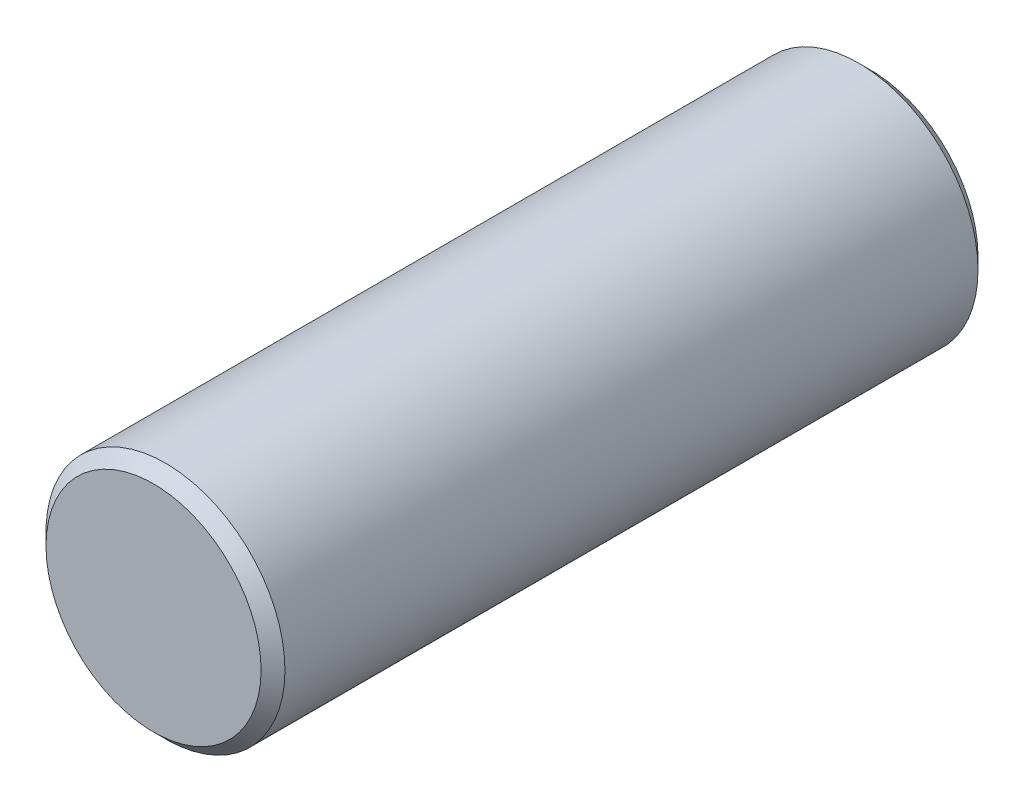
from build123d import *

# Parameters (mm, degrees)
ESQUISSE1_R     = 1
CYLINDRE_DEPTH  = 3
CHANFREIN1_SIZE = 0.1


with BuildPart() as part:
    # Esquisse1 → cylindre (new, symmetric)
    with BuildSketch(Plane.XY):
        Circle(ESQUISSE1_R)
    extrude(amount=CYLINDRE_DEPTH, both=True)

    # Chanfrein1
    chanfrein1_edges = [part.edges().sort_by_distance(p)[0] for p in [
        (-1, 0, -3),
        (-1, 0, 3),
    ]]
    chamfer(chanfrein1_edges, length=CHANFREIN1_SIZE)


solid = part.part
